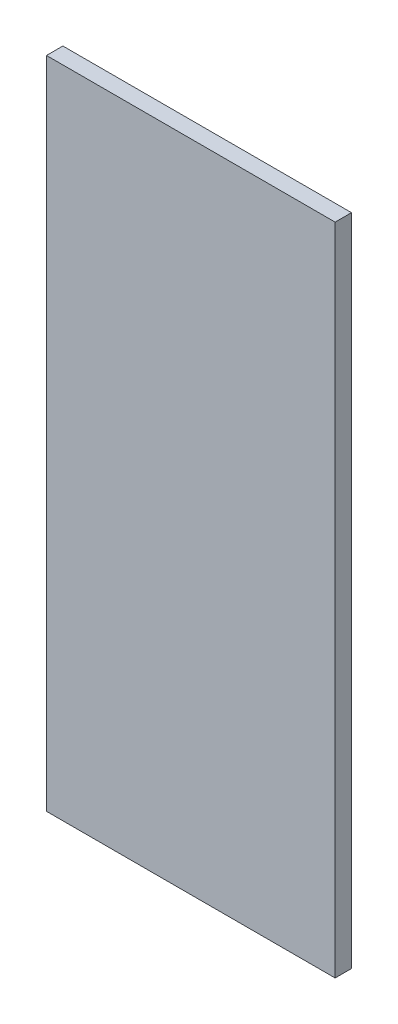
ISO-10303-21;
HEADER;
FILE_DESCRIPTION(('STEP AP214'),'2;1');
FILE_NAME('part.step','',(''),(''),'','','');
FILE_SCHEMA(('AUTOMOTIVE_DESIGN { 1 0 10303 214 1 1 1 1 }'));
ENDSEC;
DATA;
#1=APPLICATION_CONTEXT('core data for automotive mechanical design processes');
#2=APPLICATION_PROTOCOL_DEFINITION('international standard','automotive_design',2000,#1);
#3=PRODUCT_CONTEXT('',#1,'mechanical');
#4=PRODUCT('Part','Part','',(#3));
#5=PRODUCT_RELATED_PRODUCT_CATEGORY('part','',(#4));
#6=PRODUCT_DEFINITION_FORMATION('','',#4);
#7=PRODUCT_DEFINITION_CONTEXT('part definition',#1,'design');
#8=PRODUCT_DEFINITION('design','',#6,#7);
#9=PRODUCT_DEFINITION_SHAPE('','',#8);
#10=(LENGTH_UNIT() NAMED_UNIT(*) SI_UNIT(.MILLI.,.METRE.));
#11=(NAMED_UNIT(*) PLANE_ANGLE_UNIT() SI_UNIT($,.RADIAN.));
#12=(NAMED_UNIT(*) SI_UNIT($,.STERADIAN.) SOLID_ANGLE_UNIT());
#13=UNCERTAINTY_MEASURE_WITH_UNIT(LENGTH_MEASURE(1.E-05),#10,'distance_accuracy_value','');
#14=(GEOMETRIC_REPRESENTATION_CONTEXT(3) GLOBAL_UNCERTAINTY_ASSIGNED_CONTEXT((#13)) GLOBAL_UNIT_ASSIGNED_CONTEXT((#10,
#11,#12)) REPRESENTATION_CONTEXT('',''));
#15=CARTESIAN_POINT('',(0.,0.,0.));
#16=DIRECTION('',(0.,0.,1.));
#17=DIRECTION('',(1.,0.,0.));
#18=AXIS2_PLACEMENT_3D('',#15,#16,#17);
#19=CARTESIAN_POINT('',(-56.,254.,3.17500000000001));
#20=DIRECTION('',(1.,0.,0.));
#21=DIRECTION('',(0.,0.,-1.));
#22=AXIS2_PLACEMENT_3D('',#19,#20,#21);
#23=PLANE('',#22);
#24=DIRECTION('',(0.,0.,1.));
#25=VECTOR('',#24,1.);
#26=CARTESIAN_POINT('',(-56.,0.,3.17500000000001));
#27=LINE('',#26,#25);
#28=CARTESIAN_POINT('',(-56.,0.,-3.17499999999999));
#29=VERTEX_POINT('',#28);
#30=CARTESIAN_POINT('',(-56.,0.,3.17500000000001));
#31=VERTEX_POINT('',#30);
#32=EDGE_CURVE('E113',#29,#31,#27,.T.);
#33=ORIENTED_EDGE('',*,*,#32,.T.);
#34=DIRECTION('',(0.,-1.,0.));
#35=VECTOR('',#34,1.);
#36=CARTESIAN_POINT('',(-56.,254.,3.17500000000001));
#37=LINE('',#36,#35);
#38=CARTESIAN_POINT('',(-56.,254.,3.17500000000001));
#39=VERTEX_POINT('',#38);
#40=EDGE_CURVE('E11',#39,#31,#37,.T.);
#41=ORIENTED_EDGE('',*,*,#40,.F.);
#42=DIRECTION('',(0.,0.,1.));
#43=VECTOR('',#42,1.);
#44=CARTESIAN_POINT('',(-56.,254.,3.17500000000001));
#45=LINE('',#44,#43);
#46=CARTESIAN_POINT('',(-56.,254.,-3.17499999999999));
#47=VERTEX_POINT('',#46);
#48=EDGE_CURVE('E97',#47,#39,#45,.T.);
#49=ORIENTED_EDGE('',*,*,#48,.F.);
#50=DIRECTION('',(0.,-1.,0.));
#51=VECTOR('',#50,1.);
#52=CARTESIAN_POINT('',(-56.,254.,-3.17499999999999));
#53=LINE('',#52,#51);
#54=EDGE_CURVE('E109',#47,#29,#53,.T.);
#55=ORIENTED_EDGE('',*,*,#54,.T.);
#56=EDGE_LOOP('',(#33,#41,#49,#55));
#57=FACE_BOUND('',#56,.T.);
#58=ADVANCED_FACE('F45',(#57),#23,.F.);
#59=CARTESIAN_POINT('',(56.,254.,3.17499999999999));
#60=DIRECTION('',(0.,0.,-1.));
#61=DIRECTION('',(-1.,0.,0.));
#62=AXIS2_PLACEMENT_3D('',#59,#60,#61);
#63=PLANE('',#62);
#64=DIRECTION('',(1.,0.,0.));
#65=VECTOR('',#64,1.);
#66=CARTESIAN_POINT('',(56.,0.,3.17499999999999));
#67=LINE('',#66,#65);
#68=CARTESIAN_POINT('',(56.,0.,3.17499999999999));
#69=VERTEX_POINT('',#68);
#70=EDGE_CURVE('E102',#31,#69,#67,.T.);
#71=ORIENTED_EDGE('',*,*,#70,.T.);
#72=DIRECTION('',(0.,-1.,0.));
#73=VECTOR('',#72,1.);
#74=CARTESIAN_POINT('',(56.,254.,3.17499999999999));
#75=LINE('',#74,#73);
#76=CARTESIAN_POINT('',(56.,254.,3.17499999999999));
#77=VERTEX_POINT('',#76);
#78=EDGE_CURVE('E54',#77,#69,#75,.T.);
#79=ORIENTED_EDGE('',*,*,#78,.F.);
#80=DIRECTION('',(1.,0.,0.));
#81=VECTOR('',#80,1.);
#82=CARTESIAN_POINT('',(56.,254.,3.17499999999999));
#83=LINE('',#82,#81);
#84=EDGE_CURVE('E92',#39,#77,#83,.T.);
#85=ORIENTED_EDGE('',*,*,#84,.F.);
#86=ORIENTED_EDGE('',*,*,#40,.T.);
#87=EDGE_LOOP('',(#71,#79,#85,#86));
#88=FACE_BOUND('',#87,.T.);
#89=ADVANCED_FACE('F101',(#88),#63,.F.);
#90=CARTESIAN_POINT('',(56.,254.,3.17499999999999));
#91=DIRECTION('',(-1.,0.,0.));
#92=DIRECTION('',(0.,0.,1.));
#93=AXIS2_PLACEMENT_3D('',#90,#91,#92);
#94=PLANE('',#93);
#95=DIRECTION('',(0.,0.,-1.));
#96=VECTOR('',#95,1.);
#97=CARTESIAN_POINT('',(56.,0.,3.17499999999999));
#98=LINE('',#97,#96);
#99=CARTESIAN_POINT('',(56.,0.,-3.17500000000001));
#100=VERTEX_POINT('',#99);
#101=EDGE_CURVE('E79',#69,#100,#98,.T.);
#102=ORIENTED_EDGE('',*,*,#101,.T.);
#103=DIRECTION('',(0.,-1.,0.));
#104=VECTOR('',#103,1.);
#105=CARTESIAN_POINT('',(56.,254.,-3.17500000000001));
#106=LINE('',#105,#104);
#107=CARTESIAN_POINT('',(56.,254.,-3.17500000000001));
#108=VERTEX_POINT('',#107);
#109=EDGE_CURVE('E104',#108,#100,#106,.T.);
#110=ORIENTED_EDGE('',*,*,#109,.F.);
#111=DIRECTION('',(0.,0.,-1.));
#112=VECTOR('',#111,1.);
#113=CARTESIAN_POINT('',(56.,254.,3.17499999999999));
#114=LINE('',#113,#112);
#115=EDGE_CURVE('E95',#77,#108,#114,.T.);
#116=ORIENTED_EDGE('',*,*,#115,.F.);
#117=ORIENTED_EDGE('',*,*,#78,.T.);
#118=EDGE_LOOP('',(#102,#110,#116,#117));
#119=FACE_BOUND('',#118,.T.);
#120=ADVANCED_FACE('F105',(#119),#94,.F.);
#121=CARTESIAN_POINT('',(56.,254.,-3.17500000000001));
#122=DIRECTION('',(0.,0.,1.));
#123=DIRECTION('',(1.,0.,0.));
#124=AXIS2_PLACEMENT_3D('',#121,#122,#123);
#125=PLANE('',#124);
#126=DIRECTION('',(-1.,0.,0.));
#127=VECTOR('',#126,1.);
#128=CARTESIAN_POINT('',(56.,0.,-3.17500000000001));
#129=LINE('',#128,#127);
#130=EDGE_CURVE('E85',#100,#29,#129,.T.);
#131=ORIENTED_EDGE('',*,*,#130,.T.);
#132=ORIENTED_EDGE('',*,*,#54,.F.);
#133=DIRECTION('',(-1.,0.,0.));
#134=VECTOR('',#133,1.);
#135=CARTESIAN_POINT('',(56.,254.,-3.17500000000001));
#136=LINE('',#135,#134);
#137=EDGE_CURVE('E62',#108,#47,#136,.T.);
#138=ORIENTED_EDGE('',*,*,#137,.F.);
#139=ORIENTED_EDGE('',*,*,#109,.T.);
#140=EDGE_LOOP('',(#131,#132,#138,#139));
#141=FACE_BOUND('',#140,.T.);
#142=ADVANCED_FACE('F126',(#141),#125,.F.);
#143=CARTESIAN_POINT('',(0.,254.,0.));
#144=DIRECTION('',(0.,1.,0.));
#145=DIRECTION('',(0.,0.,1.));
#146=AXIS2_PLACEMENT_3D('',#143,#144,#145);
#147=PLANE('',#146);
#148=ORIENTED_EDGE('',*,*,#48,.T.);
#149=ORIENTED_EDGE('',*,*,#84,.T.);
#150=ORIENTED_EDGE('',*,*,#115,.T.);
#151=ORIENTED_EDGE('',*,*,#137,.T.);
#152=EDGE_LOOP('',(#148,#149,#150,#151));
#153=FACE_BOUND('',#152,.T.);
#154=ADVANCED_FACE('F93',(#153),#147,.T.);
#155=CARTESIAN_POINT('',(0.,0.,0.));
#156=DIRECTION('',(0.,1.,0.));
#157=DIRECTION('',(0.,0.,1.));
#158=AXIS2_PLACEMENT_3D('',#155,#156,#157);
#159=PLANE('',#158);
#160=ORIENTED_EDGE('',*,*,#32,.F.);
#161=ORIENTED_EDGE('',*,*,#130,.F.);
#162=ORIENTED_EDGE('',*,*,#101,.F.);
#163=ORIENTED_EDGE('',*,*,#70,.F.);
#164=EDGE_LOOP('',(#160,#161,#162,#163));
#165=FACE_BOUND('',#164,.T.);
#166=ADVANCED_FACE('F129',(#165),#159,.F.);
#167=CLOSED_SHELL('',(#58,#89,#120,#142,#154,#166));
#168=MANIFOLD_SOLID_BREP('B2',#167);
#169=ADVANCED_BREP_SHAPE_REPRESENTATION('',(#18,#168),#14);
#170=SHAPE_DEFINITION_REPRESENTATION(#9,#169);
ENDSEC;
END-ISO-10303-21;
